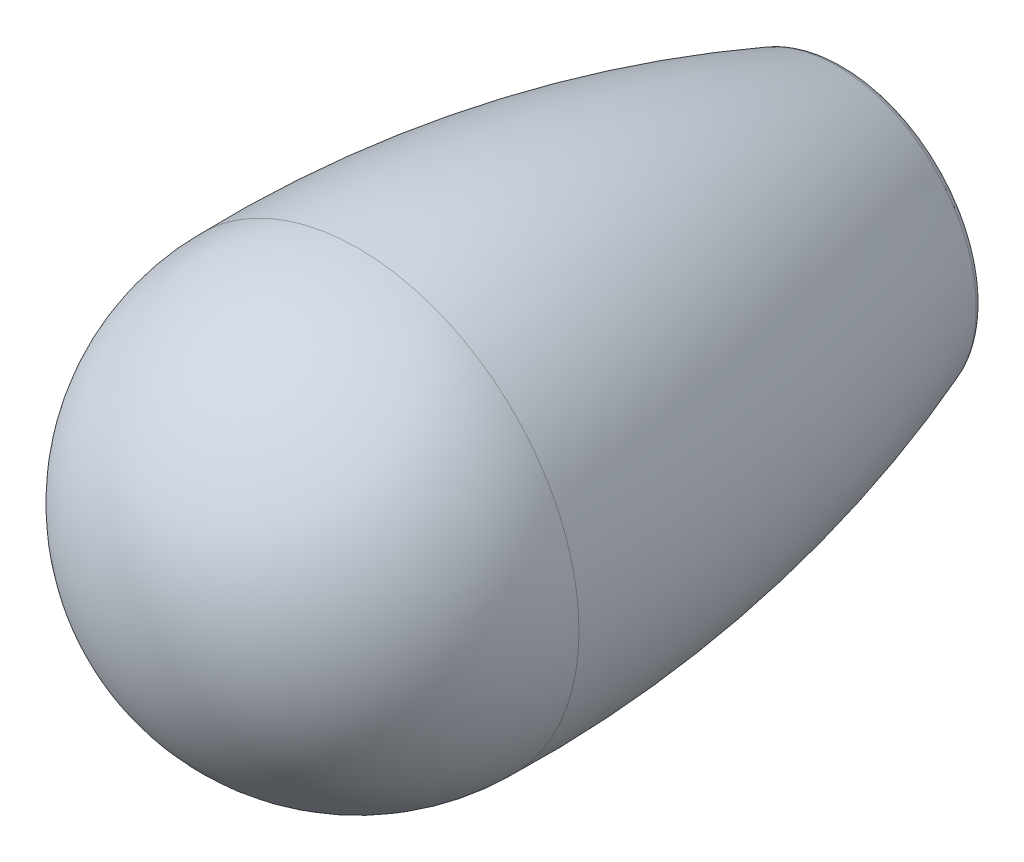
ISO-10303-21;
HEADER;
FILE_DESCRIPTION(('STEP AP214'),'2;1');
FILE_NAME('part.step','',(''),(''),'','','');
FILE_SCHEMA(('AUTOMOTIVE_DESIGN { 1 0 10303 214 1 1 1 1 }'));
ENDSEC;
DATA;
#1=APPLICATION_CONTEXT('core data for automotive mechanical design processes');
#2=APPLICATION_PROTOCOL_DEFINITION('international standard','automotive_design',2000,#1);
#3=PRODUCT_CONTEXT('',#1,'mechanical');
#4=PRODUCT('Part','Part','',(#3));
#5=PRODUCT_RELATED_PRODUCT_CATEGORY('part','',(#4));
#6=PRODUCT_DEFINITION_FORMATION('','',#4);
#7=PRODUCT_DEFINITION_CONTEXT('part definition',#1,'design');
#8=PRODUCT_DEFINITION('design','',#6,#7);
#9=PRODUCT_DEFINITION_SHAPE('','',#8);
#10=(LENGTH_UNIT() NAMED_UNIT(*) SI_UNIT(.MILLI.,.METRE.));
#11=(NAMED_UNIT(*) PLANE_ANGLE_UNIT() SI_UNIT($,.RADIAN.));
#12=(NAMED_UNIT(*) SI_UNIT($,.STERADIAN.) SOLID_ANGLE_UNIT());
#13=UNCERTAINTY_MEASURE_WITH_UNIT(LENGTH_MEASURE(1.E-05),#10,'distance_accuracy_value','');
#14=(GEOMETRIC_REPRESENTATION_CONTEXT(3) GLOBAL_UNCERTAINTY_ASSIGNED_CONTEXT((#13)) GLOBAL_UNIT_ASSIGNED_CONTEXT((#10,
#11,#12)) REPRESENTATION_CONTEXT('',''));
#15=CARTESIAN_POINT('',(0.,0.,0.));
#16=DIRECTION('',(0.,0.,1.));
#17=DIRECTION('',(1.,0.,0.));
#18=AXIS2_PLACEMENT_3D('',#15,#16,#17);
#19=CARTESIAN_POINT('',(0.,0.,35.6035649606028));
#20=DIRECTION('',(0.,0.,1.));
#21=DIRECTION('',(-1.,0.,0.));
#22=AXIS2_PLACEMENT_3D('',#19,#20,#21);
#23=DEGENERATE_TOROIDAL_SURFACE('',#22,83.4821055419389,100.5,.F.);
#24=CARTESIAN_POINT('',(0.,0.,37.5));
#25=DIRECTION('',(0.,0.,1.));
#26=DIRECTION('',(-1.,0.,0.));
#27=AXIS2_PLACEMENT_3D('',#24,#25,#26);
#28=CIRCLE('',#27,17.);
#29=CARTESIAN_POINT('',(-17.,0.,37.5));
#30=VERTEX_POINT('',#29);
#31=EDGE_CURVE('E8',#30,#30,#28,.T.);
#32=ORIENTED_EDGE('',*,*,#31,.F.);
#33=EDGE_LOOP('',(#32));
#34=FACE_BOUND('',#33,.T.);
#35=CARTESIAN_POINT('',(0.,0.,0.65222547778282));
#36=DIRECTION('',(0.,0.,1.));
#37=DIRECTION('',(-1.,0.,0.));
#38=AXIS2_PLACEMENT_3D('',#35,#36,#37);
#39=CIRCLE('',#38,10.7445035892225);
#40=CARTESIAN_POINT('',(-10.7445035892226,0.,0.65222547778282));
#41=VERTEX_POINT('',#40);
#42=EDGE_CURVE('E37',#41,#41,#39,.T.);
#43=ORIENTED_EDGE('',*,*,#42,.T.);
#44=EDGE_LOOP('',(#43));
#45=FACE_BOUND('',#44,.T.);
#46=ADVANCED_FACE('F12',(#34,#45),#23,.F.);
#47=CARTESIAN_POINT('',(0.,0.,37.5));
#48=DIRECTION('',(0.,0.,1.));
#49=DIRECTION('',(1.,0.,0.));
#50=AXIS2_PLACEMENT_3D('',#47,#48,#49);
#51=SPHERICAL_SURFACE('',#50,17.);
#52=ORIENTED_EDGE('',*,*,#31,.T.);
#53=EDGE_LOOP('',(#52));
#54=FACE_BOUND('',#53,.T.);
#55=ADVANCED_FACE('F75',(#54),#51,.T.);
#56=CARTESIAN_POINT('',(2.75,0.,50.));
#57=DIRECTION('',(0.,0.,1.));
#58=DIRECTION('',(-1.,0.,0.));
#59=AXIS2_PLACEMENT_3D('',#56,#57,#58);
#60=PLANE('',#59);
#61=CARTESIAN_POINT('',(0.,0.,50.));
#62=DIRECTION('',(0.,0.,1.));
#63=DIRECTION('',(-1.,0.,0.));
#64=AXIS2_PLACEMENT_3D('',#61,#62,#63);
#65=CIRCLE('',#64,2.75);
#66=CARTESIAN_POINT('',(-2.75000000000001,0.,50.));
#67=VERTEX_POINT('',#66);
#68=EDGE_CURVE('E18',#67,#67,#65,.T.);
#69=ORIENTED_EDGE('',*,*,#68,.F.);
#70=EDGE_LOOP('',(#69));
#71=FACE_BOUND('',#70,.T.);
#72=ADVANCED_FACE('F68',(#71),#60,.F.);
#73=CARTESIAN_POINT('',(0.,0.,54.5));
#74=DIRECTION('',(0.,0.,1.));
#75=DIRECTION('',(-1.,0.,0.));
#76=AXIS2_PLACEMENT_3D('',#73,#74,#75);
#77=CYLINDRICAL_SURFACE('',#76,2.75);
#78=CARTESIAN_POINT('',(0.,0.,40.));
#79=DIRECTION('',(0.,0.,1.));
#80=DIRECTION('',(-1.,0.,0.));
#81=AXIS2_PLACEMENT_3D('',#78,#79,#80);
#82=CIRCLE('',#81,2.75);
#83=CARTESIAN_POINT('',(-2.75000000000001,0.,40.));
#84=VERTEX_POINT('',#83);
#85=EDGE_CURVE('E22',#84,#84,#82,.T.);
#86=ORIENTED_EDGE('',*,*,#85,.F.);
#87=EDGE_LOOP('',(#86));
#88=FACE_BOUND('',#87,.T.);
#89=ORIENTED_EDGE('',*,*,#68,.T.);
#90=EDGE_LOOP('',(#89));
#91=FACE_BOUND('',#90,.T.);
#92=ADVANCED_FACE('F63',(#88,#91),#77,.F.);
#93=CARTESIAN_POINT('',(5.,0.,40.));
#94=DIRECTION('',(0.,0.,1.));
#95=DIRECTION('',(-1.,0.,0.));
#96=AXIS2_PLACEMENT_3D('',#93,#94,#95);
#97=PLANE('',#96);
#98=CARTESIAN_POINT('',(0.,0.,40.));
#99=DIRECTION('',(0.,0.,1.));
#100=DIRECTION('',(-1.,0.,0.));
#101=AXIS2_PLACEMENT_3D('',#98,#99,#100);
#102=CIRCLE('',#101,5.);
#103=CARTESIAN_POINT('',(-5.00000000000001,0.,40.));
#104=VERTEX_POINT('',#103);
#105=EDGE_CURVE('E26',#104,#104,#102,.T.);
#106=ORIENTED_EDGE('',*,*,#105,.F.);
#107=EDGE_LOOP('',(#106));
#108=FACE_BOUND('',#107,.T.);
#109=ORIENTED_EDGE('',*,*,#85,.T.);
#110=EDGE_LOOP('',(#109));
#111=FACE_BOUND('',#110,.T.);
#112=ADVANCED_FACE('F57',(#108,#111),#97,.F.);
#113=CARTESIAN_POINT('',(0.,0.,54.5));
#114=DIRECTION('',(0.,0.,1.));
#115=DIRECTION('',(-1.,0.,0.));
#116=AXIS2_PLACEMENT_3D('',#113,#114,#115);
#117=CYLINDRICAL_SURFACE('',#116,5.);
#118=CARTESIAN_POINT('',(0.,0.,0.));
#119=DIRECTION('',(0.,0.,1.));
#120=DIRECTION('',(-1.,0.,0.));
#121=AXIS2_PLACEMENT_3D('',#118,#119,#120);
#122=CIRCLE('',#121,5.);
#123=CARTESIAN_POINT('',(-5.00000000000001,0.,0.));
#124=VERTEX_POINT('',#123);
#125=EDGE_CURVE('E31',#124,#124,#122,.T.);
#126=ORIENTED_EDGE('',*,*,#125,.F.);
#127=EDGE_LOOP('',(#126));
#128=FACE_BOUND('',#127,.T.);
#129=ORIENTED_EDGE('',*,*,#105,.T.);
#130=EDGE_LOOP('',(#129));
#131=FACE_BOUND('',#130,.T.);
#132=ADVANCED_FACE('F51',(#128,#131),#117,.F.);
#133=CARTESIAN_POINT('',(9.80692538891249,0.,0.));
#134=DIRECTION('',(0.,0.,1.));
#135=DIRECTION('',(-1.,0.,0.));
#136=AXIS2_PLACEMENT_3D('',#133,#134,#135);
#137=PLANE('',#136);
#138=CARTESIAN_POINT('',(0.,0.,0.));
#139=DIRECTION('',(0.,0.,1.));
#140=DIRECTION('',(-1.,0.,0.));
#141=AXIS2_PLACEMENT_3D('',#138,#139,#140);
#142=CIRCLE('',#141,9.80692538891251);
#143=CARTESIAN_POINT('',(-9.80692538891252,0.,0.));
#144=VERTEX_POINT('',#143);
#145=EDGE_CURVE('E34',#144,#144,#142,.T.);
#146=ORIENTED_EDGE('',*,*,#145,.F.);
#147=EDGE_LOOP('',(#146));
#148=FACE_BOUND('',#147,.T.);
#149=ORIENTED_EDGE('',*,*,#125,.T.);
#150=EDGE_LOOP('',(#149));
#151=FACE_BOUND('',#150,.T.);
#152=ADVANCED_FACE('F45',(#148,#151),#137,.F.);
#153=CARTESIAN_POINT('',(0.,0.,1.));
#154=DIRECTION('',(0.,0.,1.));
#155=DIRECTION('',(-1.,0.,0.));
#156=AXIS2_PLACEMENT_3D('',#153,#154,#155);
#157=TOROIDAL_SURFACE('',#156,9.80692538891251,1.);
#158=ORIENTED_EDGE('',*,*,#42,.F.);
#159=EDGE_LOOP('',(#158));
#160=FACE_BOUND('',#159,.T.);
#161=ORIENTED_EDGE('',*,*,#145,.T.);
#162=EDGE_LOOP('',(#161));
#163=FACE_BOUND('',#162,.T.);
#164=ADVANCED_FACE('F42',(#160,#163),#157,.T.);
#165=CLOSED_SHELL('',(#46,#55,#72,#92,#112,#132,#152,#164));
#166=MANIFOLD_SOLID_BREP('B1',#165);
#167=ADVANCED_BREP_SHAPE_REPRESENTATION('',(#18,#166),#14);
#168=SHAPE_DEFINITION_REPRESENTATION(#9,#167);
ENDSEC;
END-ISO-10303-21;
